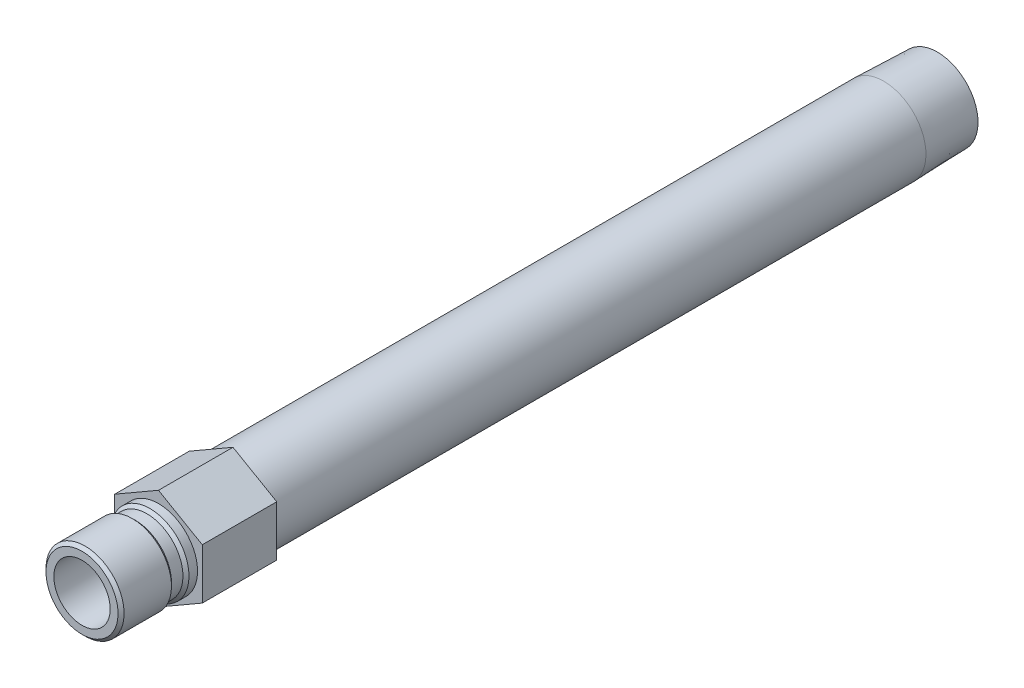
ISO-10303-21;
HEADER;
FILE_DESCRIPTION(('STEP AP214'),'2;1');
FILE_NAME('part.step','',(''),(''),'','','');
FILE_SCHEMA(('AUTOMOTIVE_DESIGN { 1 0 10303 214 1 1 1 1 }'));
ENDSEC;
DATA;
#1=APPLICATION_CONTEXT('core data for automotive mechanical design processes');
#2=APPLICATION_PROTOCOL_DEFINITION('international standard','automotive_design',2000,#1);
#3=PRODUCT_CONTEXT('',#1,'mechanical');
#4=PRODUCT('Part','Part','',(#3));
#5=PRODUCT_RELATED_PRODUCT_CATEGORY('part','',(#4));
#6=PRODUCT_DEFINITION_FORMATION('','',#4);
#7=PRODUCT_DEFINITION_CONTEXT('part definition',#1,'design');
#8=PRODUCT_DEFINITION('design','',#6,#7);
#9=PRODUCT_DEFINITION_SHAPE('','',#8);
#10=(LENGTH_UNIT() NAMED_UNIT(*) SI_UNIT(.MILLI.,.METRE.));
#11=(NAMED_UNIT(*) PLANE_ANGLE_UNIT() SI_UNIT($,.RADIAN.));
#12=(NAMED_UNIT(*) SI_UNIT($,.STERADIAN.) SOLID_ANGLE_UNIT());
#13=UNCERTAINTY_MEASURE_WITH_UNIT(LENGTH_MEASURE(1.E-05),#10,'distance_accuracy_value','');
#14=(GEOMETRIC_REPRESENTATION_CONTEXT(3) GLOBAL_UNCERTAINTY_ASSIGNED_CONTEXT((#13)) GLOBAL_UNIT_ASSIGNED_CONTEXT((#10,
#11,#12)) REPRESENTATION_CONTEXT('',''));
#15=CARTESIAN_POINT('',(0.,0.,0.));
#16=DIRECTION('',(0.,0.,1.));
#17=DIRECTION('',(1.,0.,0.));
#18=AXIS2_PLACEMENT_3D('',#15,#16,#17);
#19=CARTESIAN_POINT('',(0.,0.,0.));
#20=DIRECTION('',(0.,0.,-1.));
#21=DIRECTION('',(0.,1.,0.));
#22=AXIS2_PLACEMENT_3D('',#19,#20,#21);
#23=CYLINDRICAL_SURFACE('',#22,7.112);
#24=CARTESIAN_POINT('',(0.,0.,1.524));
#25=DIRECTION('',(0.,0.,-1.));
#26=DIRECTION('',(0.,1.,0.));
#27=AXIS2_PLACEMENT_3D('',#24,#25,#26);
#28=CIRCLE('',#27,7.112);
#29=CARTESIAN_POINT('',(0.,7.112,1.524));
#30=VERTEX_POINT('',#29);
#31=EDGE_CURVE('E147',#30,#30,#28,.T.);
#32=ORIENTED_EDGE('',*,*,#31,.T.);
#33=EDGE_LOOP('',(#32));
#34=FACE_BOUND('',#33,.T.);
#35=CARTESIAN_POINT('',(0.,0.,19.304));
#36=DIRECTION('',(0.,0.,-1.));
#37=DIRECTION('',(0.,1.,0.));
#38=AXIS2_PLACEMENT_3D('',#35,#36,#37);
#39=CIRCLE('',#38,7.112);
#40=CARTESIAN_POINT('',(0.,7.112,19.304));
#41=VERTEX_POINT('',#40);
#42=EDGE_CURVE('E42',#41,#41,#39,.T.);
#43=ORIENTED_EDGE('',*,*,#42,.F.);
#44=EDGE_LOOP('',(#43));
#45=FACE_BOUND('',#44,.T.);
#46=ADVANCED_FACE('F33',(#34,#45),#23,.F.);
#47=CARTESIAN_POINT('',(0.,7.112,19.304));
#48=DIRECTION('',(0.,0.,1.));
#49=DIRECTION('',(0.,-1.,0.));
#50=AXIS2_PLACEMENT_3D('',#47,#48,#49);
#51=PLANE('',#50);
#52=ORIENTED_EDGE('',*,*,#42,.T.);
#53=EDGE_LOOP('',(#52));
#54=FACE_BOUND('',#53,.T.);
#55=CARTESIAN_POINT('',(0.,0.,19.304));
#56=DIRECTION('',(0.,0.,-1.));
#57=DIRECTION('',(0.,1.,0.));
#58=AXIS2_PLACEMENT_3D('',#55,#56,#57);
#59=CIRCLE('',#58,9.0932);
#60=CARTESIAN_POINT('',(0.,9.0932,19.304));
#61=VERTEX_POINT('',#60);
#62=EDGE_CURVE('E180',#61,#61,#59,.T.);
#63=ORIENTED_EDGE('',*,*,#62,.F.);
#64=EDGE_LOOP('',(#63));
#65=FACE_BOUND('',#64,.T.);
#66=ADVANCED_FACE('F186',(#54,#65),#51,.T.);
#67=CARTESIAN_POINT('',(0.,0.,18.542));
#68=DIRECTION('',(0.,0.,-1.));
#69=DIRECTION('',(0.,1.,0.));
#70=AXIS2_PLACEMENT_3D('',#67,#68,#69);
#71=CONICAL_SURFACE('',#70,9.8552,0.785398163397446);
#72=ORIENTED_EDGE('',*,*,#62,.T.);
#73=EDGE_LOOP('',(#72));
#74=FACE_BOUND('',#73,.T.);
#75=CARTESIAN_POINT('',(0.,0.,18.542));
#76=DIRECTION('',(0.,0.,-1.));
#77=DIRECTION('',(0.,1.,0.));
#78=AXIS2_PLACEMENT_3D('',#75,#76,#77);
#79=CIRCLE('',#78,9.8552);
#80=CARTESIAN_POINT('',(0.,9.8552,18.542));
#81=VERTEX_POINT('',#80);
#82=EDGE_CURVE('E177',#81,#81,#79,.T.);
#83=ORIENTED_EDGE('',*,*,#82,.F.);
#84=EDGE_LOOP('',(#83));
#85=FACE_BOUND('',#84,.T.);
#86=ADVANCED_FACE('F194',(#74,#85),#71,.T.);
#87=CARTESIAN_POINT('',(0.,0.,0.));
#88=DIRECTION('',(0.,0.,-1.));
#89=DIRECTION('',(0.,1.,0.));
#90=AXIS2_PLACEMENT_3D('',#87,#88,#89);
#91=CYLINDRICAL_SURFACE('',#90,9.8552);
#92=ORIENTED_EDGE('',*,*,#82,.T.);
#93=EDGE_LOOP('',(#92));
#94=FACE_BOUND('',#93,.T.);
#95=CARTESIAN_POINT('',(0.,0.,6.5786));
#96=DIRECTION('',(0.,0.,-1.));
#97=DIRECTION('',(0.,1.,0.));
#98=AXIS2_PLACEMENT_3D('',#95,#96,#97);
#99=CIRCLE('',#98,9.8552);
#100=CARTESIAN_POINT('',(0.,9.8552,6.5786));
#101=VERTEX_POINT('',#100);
#102=EDGE_CURVE('E174',#101,#101,#99,.T.);
#103=ORIENTED_EDGE('',*,*,#102,.F.);
#104=EDGE_LOOP('',(#103));
#105=FACE_BOUND('',#104,.T.);
#106=ADVANCED_FACE('F249',(#94,#105),#91,.T.);
#107=CARTESIAN_POINT('',(0.,0.,5.8166));
#108=DIRECTION('',(0.,0.,1.));
#109=DIRECTION('',(0.,-1.,0.));
#110=AXIS2_PLACEMENT_3D('',#107,#108,#109);
#111=CONICAL_SURFACE('',#110,9.0932,0.785398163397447);
#112=ORIENTED_EDGE('',*,*,#102,.T.);
#113=EDGE_LOOP('',(#112));
#114=FACE_BOUND('',#113,.T.);
#115=CARTESIAN_POINT('',(0.,0.,5.8166));
#116=DIRECTION('',(0.,0.,-1.));
#117=DIRECTION('',(0.,1.,0.));
#118=AXIS2_PLACEMENT_3D('',#115,#116,#117);
#119=CIRCLE('',#118,9.0932);
#120=CARTESIAN_POINT('',(0.,9.0932,5.8166));
#121=VERTEX_POINT('',#120);
#122=EDGE_CURVE('E171',#121,#121,#119,.T.);
#123=ORIENTED_EDGE('',*,*,#122,.F.);
#124=EDGE_LOOP('',(#123));
#125=FACE_BOUND('',#124,.T.);
#126=ADVANCED_FACE('F245',(#114,#125),#111,.T.);
#127=CARTESIAN_POINT('',(0.,0.,0.));
#128=DIRECTION('',(0.,0.,-1.));
#129=DIRECTION('',(0.,1.,0.));
#130=AXIS2_PLACEMENT_3D('',#127,#128,#129);
#131=CYLINDRICAL_SURFACE('',#130,9.0932);
#132=ORIENTED_EDGE('',*,*,#122,.T.);
#133=EDGE_LOOP('',(#132));
#134=FACE_BOUND('',#133,.T.);
#135=CARTESIAN_POINT('',(0.,0.,2.921));
#136=DIRECTION('',(0.,0.,-1.));
#137=DIRECTION('',(0.,1.,0.));
#138=AXIS2_PLACEMENT_3D('',#135,#136,#137);
#139=CIRCLE('',#138,9.0932);
#140=CARTESIAN_POINT('',(0.,9.0932,2.921));
#141=VERTEX_POINT('',#140);
#142=EDGE_CURVE('E168',#141,#141,#139,.T.);
#143=ORIENTED_EDGE('',*,*,#142,.F.);
#144=EDGE_LOOP('',(#143));
#145=FACE_BOUND('',#144,.T.);
#146=ADVANCED_FACE('F241',(#134,#145),#131,.T.);
#147=CARTESIAN_POINT('',(0.,0.,2.159));
#148=DIRECTION('',(0.,0.,-1.));
#149=DIRECTION('',(0.,1.,0.));
#150=AXIS2_PLACEMENT_3D('',#147,#148,#149);
#151=CONICAL_SURFACE('',#150,9.8552,0.785398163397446);
#152=ORIENTED_EDGE('',*,*,#142,.T.);
#153=EDGE_LOOP('',(#152));
#154=FACE_BOUND('',#153,.T.);
#155=CARTESIAN_POINT('',(0.,0.,2.159));
#156=DIRECTION('',(0.,0.,-1.));
#157=DIRECTION('',(0.,1.,0.));
#158=AXIS2_PLACEMENT_3D('',#155,#156,#157);
#159=CIRCLE('',#158,9.8552);
#160=CARTESIAN_POINT('',(0.,9.8552,2.159));
#161=VERTEX_POINT('',#160);
#162=EDGE_CURVE('E165',#161,#161,#159,.T.);
#163=ORIENTED_EDGE('',*,*,#162,.F.);
#164=EDGE_LOOP('',(#163));
#165=FACE_BOUND('',#164,.T.);
#166=ADVANCED_FACE('F237',(#154,#165),#151,.T.);
#167=CARTESIAN_POINT('',(0.,0.,0.));
#168=DIRECTION('',(0.,0.,-1.));
#169=DIRECTION('',(0.,1.,0.));
#170=AXIS2_PLACEMENT_3D('',#167,#168,#169);
#171=CYLINDRICAL_SURFACE('',#170,9.8552);
#172=ORIENTED_EDGE('',*,*,#162,.T.);
#173=EDGE_LOOP('',(#172));
#174=FACE_BOUND('',#173,.T.);
#175=CARTESIAN_POINT('',(0.,0.,0.));
#176=DIRECTION('',(0.,0.,-1.));
#177=DIRECTION('',(0.,1.,0.));
#178=AXIS2_PLACEMENT_3D('',#175,#176,#177);
#179=CIRCLE('',#178,9.8552);
#180=CARTESIAN_POINT('',(0.,9.8552,0.));
#181=VERTEX_POINT('',#180);
#182=EDGE_CURVE('E162',#181,#181,#179,.T.);
#183=ORIENTED_EDGE('',*,*,#182,.F.);
#184=EDGE_LOOP('',(#183));
#185=FACE_BOUND('',#184,.T.);
#186=ADVANCED_FACE('F233',(#174,#185),#171,.T.);
#187=CARTESIAN_POINT('',(0.,9.8552,0.));
#188=DIRECTION('',(0.,0.,1.));
#189=DIRECTION('',(0.,-1.,0.));
#190=AXIS2_PLACEMENT_3D('',#187,#188,#189);
#191=PLANE('',#190);
#192=ORIENTED_EDGE('',*,*,#182,.T.);
#193=EDGE_LOOP('',(#192));
#194=FACE_BOUND('',#193,.T.);
#195=DIRECTION('',(-0.866025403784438,-0.5,0.));
#196=VECTOR('',#195,1.);
#197=CARTESIAN_POINT('',(0.,12.7582862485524,0.));
#198=LINE('',#197,#196);
#199=CARTESIAN_POINT('',(0.,12.7582862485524,0.));
#200=VERTEX_POINT('',#199);
#201=CARTESIAN_POINT('',(-11.049,6.37914312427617,0.));
#202=VERTEX_POINT('',#201);
#203=EDGE_CURVE('E121',#200,#202,#198,.T.);
#204=ORIENTED_EDGE('',*,*,#203,.T.);
#205=DIRECTION('',(0.,-1.,0.));
#206=VECTOR('',#205,1.);
#207=CARTESIAN_POINT('',(-11.049,6.37914312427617,0.));
#208=LINE('',#207,#206);
#209=CARTESIAN_POINT('',(-11.049,-6.37914312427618,0.));
#210=VERTEX_POINT('',#209);
#211=EDGE_CURVE('E124',#202,#210,#208,.T.);
#212=ORIENTED_EDGE('',*,*,#211,.T.);
#213=DIRECTION('',(0.866025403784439,-0.5,0.));
#214=VECTOR('',#213,1.);
#215=CARTESIAN_POINT('',(-11.049,-6.37914312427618,0.));
#216=LINE('',#215,#214);
#217=CARTESIAN_POINT('',(0.,-12.7582862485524,0.));
#218=VERTEX_POINT('',#217);
#219=EDGE_CURVE('E128',#210,#218,#216,.T.);
#220=ORIENTED_EDGE('',*,*,#219,.T.);
#221=DIRECTION('',(0.866025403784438,0.5,0.));
#222=VECTOR('',#221,1.);
#223=CARTESIAN_POINT('',(0.,-12.7582862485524,0.));
#224=LINE('',#223,#222);
#225=CARTESIAN_POINT('',(11.049,-6.37914312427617,0.));
#226=VERTEX_POINT('',#225);
#227=EDGE_CURVE('E131',#218,#226,#224,.T.);
#228=ORIENTED_EDGE('',*,*,#227,.T.);
#229=DIRECTION('',(0.,1.,0.));
#230=VECTOR('',#229,1.);
#231=CARTESIAN_POINT('',(11.049,-6.37914312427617,0.));
#232=LINE('',#231,#230);
#233=CARTESIAN_POINT('',(11.049,6.37914312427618,0.));
#234=VERTEX_POINT('',#233);
#235=EDGE_CURVE('E98',#226,#234,#232,.T.);
#236=ORIENTED_EDGE('',*,*,#235,.T.);
#237=DIRECTION('',(-0.866025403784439,0.5,0.));
#238=VECTOR('',#237,1.);
#239=CARTESIAN_POINT('',(11.049,6.37914312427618,0.));
#240=LINE('',#239,#238);
#241=EDGE_CURVE('E134',#234,#200,#240,.T.);
#242=ORIENTED_EDGE('',*,*,#241,.T.);
#243=EDGE_LOOP('',(#204,#212,#220,#228,#236,#242));
#244=FACE_BOUND('',#243,.T.);
#245=ADVANCED_FACE('F210',(#194,#244),#191,.T.);
#246=CARTESIAN_POINT('',(0.,0.,0.));
#247=DIRECTION('',(0.,0.,-1.));
#248=DIRECTION('',(0.,1.,0.));
#249=AXIS2_PLACEMENT_3D('',#246,#247,#248);
#250=CYLINDRICAL_SURFACE('',#249,7.89939999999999);
#251=CARTESIAN_POINT('',(0.,0.,0.));
#252=DIRECTION('',(0.,0.,1.));
#253=DIRECTION('',(1.,0.,0.));
#254=AXIS2_PLACEMENT_3D('',#251,#252,#253);
#255=CIRCLE('',#254,7.89939999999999);
#256=CARTESIAN_POINT('',(7.89939999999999,0.,0.));
#257=VERTEX_POINT('',#256);
#258=EDGE_CURVE('E11',#257,#257,#255,.T.);
#259=ORIENTED_EDGE('',*,*,#258,.F.);
#260=EDGE_LOOP('',(#259));
#261=FACE_BOUND('',#260,.T.);
#262=CARTESIAN_POINT('',(0.,0.,1.10533199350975));
#263=DIRECTION('',(0.,0.,-1.));
#264=DIRECTION('',(0.,1.,0.));
#265=AXIS2_PLACEMENT_3D('',#262,#263,#264);
#266=CIRCLE('',#265,7.8994);
#267=CARTESIAN_POINT('',(0.,7.8994,1.10533199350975));
#268=VERTEX_POINT('',#267);
#269=EDGE_CURVE('E150',#268,#268,#266,.T.);
#270=ORIENTED_EDGE('',*,*,#269,.F.);
#271=EDGE_LOOP('',(#270));
#272=FACE_BOUND('',#271,.T.);
#273=ADVANCED_FACE('F200',(#261,#272),#250,.F.);
#274=CARTESIAN_POINT('',(0.,0.,1.524));
#275=DIRECTION('',(0.,0.,-1.));
#276=DIRECTION('',(0.,1.,0.));
#277=AXIS2_PLACEMENT_3D('',#274,#275,#276);
#278=CONICAL_SURFACE('',#277,7.112,1.08210413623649);
#279=ORIENTED_EDGE('',*,*,#269,.T.);
#280=EDGE_LOOP('',(#279));
#281=FACE_BOUND('',#280,.T.);
#282=ORIENTED_EDGE('',*,*,#31,.F.);
#283=EDGE_LOOP('',(#282));
#284=FACE_BOUND('',#283,.T.);
#285=ADVANCED_FACE('F197',(#281,#284),#278,.F.);
#286=CARTESIAN_POINT('',(-11.049,6.37914312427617,-18.796));
#287=DIRECTION('',(0.,0.,1.));
#288=DIRECTION('',(1.,0.,0.));
#289=AXIS2_PLACEMENT_3D('',#286,#287,#288);
#290=PLANE('',#289);
#291=CARTESIAN_POINT('',(0.,0.,-18.796));
#292=DIRECTION('',(0.,0.,1.));
#293=DIRECTION('',(1.,0.,0.));
#294=AXIS2_PLACEMENT_3D('',#291,#292,#293);
#295=CIRCLE('',#294,7.89939999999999);
#296=CARTESIAN_POINT('',(7.89939999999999,0.,-18.796));
#297=VERTEX_POINT('',#296);
#298=EDGE_CURVE('E36',#297,#297,#295,.T.);
#299=ORIENTED_EDGE('',*,*,#298,.F.);
#300=EDGE_LOOP('',(#299));
#301=FACE_BOUND('',#300,.T.);
#302=CARTESIAN_POINT('',(0.,0.,-18.796));
#303=DIRECTION('',(0.,0.,1.));
#304=DIRECTION('',(1.,0.,0.));
#305=AXIS2_PLACEMENT_3D('',#302,#303,#304);
#306=CIRCLE('',#305,7.112);
#307=CARTESIAN_POINT('',(7.112,0.,-18.796));
#308=VERTEX_POINT('',#307);
#309=EDGE_CURVE('E125',#308,#308,#306,.T.);
#310=ORIENTED_EDGE('',*,*,#309,.T.);
#311=EDGE_LOOP('',(#310));
#312=FACE_BOUND('',#311,.T.);
#313=ADVANCED_FACE('F199',(#301,#312),#290,.F.);
#314=CARTESIAN_POINT('',(0.,0.,-18.796));
#315=DIRECTION('',(0.,0.,1.));
#316=DIRECTION('',(1.,0.,0.));
#317=AXIS2_PLACEMENT_3D('',#314,#315,#316);
#318=CYLINDRICAL_SURFACE('',#317,7.112);
#319=ORIENTED_EDGE('',*,*,#309,.F.);
#320=EDGE_LOOP('',(#319));
#321=FACE_BOUND('',#320,.T.);
#322=CARTESIAN_POINT('',(0.,0.,0.));
#323=DIRECTION('',(0.,0.,1.));
#324=DIRECTION('',(1.,0.,0.));
#325=AXIS2_PLACEMENT_3D('',#322,#323,#324);
#326=CIRCLE('',#325,7.112);
#327=CARTESIAN_POINT('',(7.112,0.,0.));
#328=VERTEX_POINT('',#327);
#329=EDGE_CURVE('E443',#328,#328,#326,.T.);
#330=ORIENTED_EDGE('',*,*,#329,.T.);
#331=EDGE_LOOP('',(#330));
#332=FACE_BOUND('',#331,.T.);
#333=ADVANCED_FACE('F207',(#321,#332),#318,.F.);
#334=CARTESIAN_POINT('',(-11.049,6.37914312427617,0.));
#335=DIRECTION('',(0.,0.,1.));
#336=DIRECTION('',(1.,0.,0.));
#337=AXIS2_PLACEMENT_3D('',#334,#335,#336);
#338=PLANE('',#337);
#339=ORIENTED_EDGE('',*,*,#258,.T.);
#340=EDGE_LOOP('',(#339));
#341=FACE_BOUND('',#340,.T.);
#342=ORIENTED_EDGE('',*,*,#329,.F.);
#343=EDGE_LOOP('',(#342));
#344=FACE_BOUND('',#343,.T.);
#345=ADVANCED_FACE('F221',(#341,#344),#338,.T.);
#346=CARTESIAN_POINT('',(0.,10.244140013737,-196.596));
#347=DIRECTION('',(0.,0.,-1.));
#348=DIRECTION('',(0.,1.,0.));
#349=AXIS2_PLACEMENT_3D('',#346,#347,#348);
#350=PLANE('',#349);
#351=CARTESIAN_POINT('',(0.,0.,-196.596));
#352=DIRECTION('',(0.,0.,-1.));
#353=DIRECTION('',(0.,1.,0.));
#354=AXIS2_PLACEMENT_3D('',#351,#352,#353);
#355=CIRCLE('',#354,10.2441400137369);
#356=CARTESIAN_POINT('',(0.,10.244140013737,-196.596));
#357=VERTEX_POINT('',#356);
#358=EDGE_CURVE('E156',#357,#357,#355,.T.);
#359=ORIENTED_EDGE('',*,*,#358,.T.);
#360=EDGE_LOOP('',(#359));
#361=FACE_BOUND('',#360,.T.);
#362=CARTESIAN_POINT('',(0.,0.,-196.596));
#363=DIRECTION('',(0.,0.,-1.));
#364=DIRECTION('',(0.,1.,0.));
#365=AXIS2_PLACEMENT_3D('',#362,#363,#364);
#366=CIRCLE('',#365,7.89939999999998);
#367=CARTESIAN_POINT('',(0.,7.8994,-196.596));
#368=VERTEX_POINT('',#367);
#369=EDGE_CURVE('E153',#368,#368,#366,.T.);
#370=ORIENTED_EDGE('',*,*,#369,.F.);
#371=EDGE_LOOP('',(#370));
#372=FACE_BOUND('',#371,.T.);
#373=ADVANCED_FACE('F218',(#361,#372),#350,.T.);
#374=ORIENTED_EDGE('',*,*,#369,.T.);
#375=EDGE_LOOP('',(#374));
#376=FACE_BOUND('',#375,.T.);
#377=ORIENTED_EDGE('',*,*,#298,.T.);
#378=EDGE_LOOP('',(#377));
#379=FACE_BOUND('',#378,.T.);
#380=ADVANCED_FACE('F213',(#376,#379),#250,.F.);
#381=CARTESIAN_POINT('',(0.,0.,-196.596));
#382=DIRECTION('',(0.,0.,1.));
#383=DIRECTION('',(0.,-1.,0.));
#384=AXIS2_PLACEMENT_3D('',#381,#382,#383);
#385=CONICAL_SURFACE('',#384,10.2441400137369,0.0312396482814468);
#386=CARTESIAN_POINT('',(0.,0.,-183.0324));
#387=DIRECTION('',(0.,0.,-1.));
#388=DIRECTION('',(0.,1.,0.));
#389=AXIS2_PLACEMENT_3D('',#386,#387,#388);
#390=CIRCLE('',#389,10.668);
#391=CARTESIAN_POINT('',(0.,10.668,-183.0324));
#392=VERTEX_POINT('',#391);
#393=EDGE_CURVE('E159',#392,#392,#390,.T.);
#394=ORIENTED_EDGE('',*,*,#393,.T.);
#395=EDGE_LOOP('',(#394));
#396=FACE_BOUND('',#395,.T.);
#397=ORIENTED_EDGE('',*,*,#358,.F.);
#398=EDGE_LOOP('',(#397));
#399=FACE_BOUND('',#398,.T.);
#400=ADVANCED_FACE('F223',(#396,#399),#385,.T.);
#401=CARTESIAN_POINT('',(0.,0.,0.));
#402=DIRECTION('',(0.,0.,-1.));
#403=DIRECTION('',(0.,1.,0.));
#404=AXIS2_PLACEMENT_3D('',#401,#402,#403);
#405=CYLINDRICAL_SURFACE('',#404,10.668);
#406=ORIENTED_EDGE('',*,*,#393,.F.);
#407=EDGE_LOOP('',(#406));
#408=FACE_BOUND('',#407,.T.);
#409=CARTESIAN_POINT('',(0.,0.,-18.796));
#410=DIRECTION('',(0.,0.,1.));
#411=DIRECTION('',(1.,0.,0.));
#412=AXIS2_PLACEMENT_3D('',#409,#410,#411);
#413=CIRCLE('',#412,10.668);
#414=CARTESIAN_POINT('',(10.668,0.,-18.796));
#415=VERTEX_POINT('',#414);
#416=EDGE_CURVE('E144',#415,#415,#413,.F.);
#417=ORIENTED_EDGE('',*,*,#416,.T.);
#418=EDGE_LOOP('',(#417));
#419=FACE_BOUND('',#418,.T.);
#420=ADVANCED_FACE('F226',(#408,#419),#405,.T.);
#421=ORIENTED_EDGE('',*,*,#416,.F.);
#422=EDGE_LOOP('',(#421));
#423=FACE_BOUND('',#422,.T.);
#424=DIRECTION('',(-0.866025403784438,-0.5,0.));
#425=VECTOR('',#424,1.);
#426=CARTESIAN_POINT('',(0.,12.7582862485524,-18.796));
#427=LINE('',#426,#425);
#428=CARTESIAN_POINT('',(0.,12.7582862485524,-18.796));
#429=VERTEX_POINT('',#428);
#430=CARTESIAN_POINT('',(-11.049,6.37914312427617,-18.796));
#431=VERTEX_POINT('',#430);
#432=EDGE_CURVE('E137',#429,#431,#427,.T.);
#433=ORIENTED_EDGE('',*,*,#432,.F.);
#434=DIRECTION('',(-0.866025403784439,0.5,0.));
#435=VECTOR('',#434,1.);
#436=CARTESIAN_POINT('',(11.049,6.37914312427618,-18.796));
#437=LINE('',#436,#435);
#438=CARTESIAN_POINT('',(11.049,6.37914312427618,-18.796));
#439=VERTEX_POINT('',#438);
#440=EDGE_CURVE('E111',#439,#429,#437,.T.);
#441=ORIENTED_EDGE('',*,*,#440,.F.);
#442=DIRECTION('',(0.,1.,0.));
#443=VECTOR('',#442,1.);
#444=CARTESIAN_POINT('',(11.049,-6.37914312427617,-18.796));
#445=LINE('',#444,#443);
#446=CARTESIAN_POINT('',(11.049,-6.37914312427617,-18.796));
#447=VERTEX_POINT('',#446);
#448=EDGE_CURVE('E96',#447,#439,#445,.T.);
#449=ORIENTED_EDGE('',*,*,#448,.F.);
#450=DIRECTION('',(0.866025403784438,0.5,0.));
#451=VECTOR('',#450,1.);
#452=CARTESIAN_POINT('',(0.,-12.7582862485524,-18.796));
#453=LINE('',#452,#451);
#454=CARTESIAN_POINT('',(0.,-12.7582862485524,-18.796));
#455=VERTEX_POINT('',#454);
#456=EDGE_CURVE('E109',#455,#447,#453,.T.);
#457=ORIENTED_EDGE('',*,*,#456,.F.);
#458=DIRECTION('',(0.866025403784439,-0.5,0.));
#459=VECTOR('',#458,1.);
#460=CARTESIAN_POINT('',(-11.049,-6.37914312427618,-18.796));
#461=LINE('',#460,#459);
#462=CARTESIAN_POINT('',(-11.049,-6.37914312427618,-18.796));
#463=VERTEX_POINT('',#462);
#464=EDGE_CURVE('E114',#463,#455,#461,.T.);
#465=ORIENTED_EDGE('',*,*,#464,.F.);
#466=DIRECTION('',(0.,-1.,0.));
#467=VECTOR('',#466,1.);
#468=CARTESIAN_POINT('',(-11.049,6.37914312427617,-18.796));
#469=LINE('',#468,#467);
#470=EDGE_CURVE('E116',#431,#463,#469,.T.);
#471=ORIENTED_EDGE('',*,*,#470,.F.);
#472=EDGE_LOOP('',(#433,#441,#449,#457,#465,#471));
#473=FACE_BOUND('',#472,.T.);
#474=ADVANCED_FACE('F107',(#423,#473),#290,.F.);
#475=CARTESIAN_POINT('',(0.,12.7582862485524,-18.796));
#476=DIRECTION('',(-0.5,0.866025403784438,0.));
#477=DIRECTION('',(-0.866025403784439,-0.5,0.));
#478=AXIS2_PLACEMENT_3D('',#475,#476,#477);
#479=PLANE('',#478);
#480=ORIENTED_EDGE('',*,*,#203,.F.);
#481=DIRECTION('',(0.,0.,1.));
#482=VECTOR('',#481,1.);
#483=CARTESIAN_POINT('',(0.,12.7582862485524,-18.796));
#484=LINE('',#483,#482);
#485=EDGE_CURVE('E50',#429,#200,#484,.T.);
#486=ORIENTED_EDGE('',*,*,#485,.F.);
#487=ORIENTED_EDGE('',*,*,#432,.T.);
#488=DIRECTION('',(0.,0.,1.));
#489=VECTOR('',#488,1.);
#490=CARTESIAN_POINT('',(-11.049,6.37914312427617,-18.796));
#491=LINE('',#490,#489);
#492=EDGE_CURVE('E85',#431,#202,#491,.T.);
#493=ORIENTED_EDGE('',*,*,#492,.T.);
#494=EDGE_LOOP('',(#480,#486,#487,#493));
#495=FACE_BOUND('',#494,.T.);
#496=ADVANCED_FACE('F215',(#495),#479,.T.);
#497=CARTESIAN_POINT('',(11.049,6.37914312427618,-18.796));
#498=DIRECTION('',(0.5,0.866025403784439,0.));
#499=DIRECTION('',(-0.866025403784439,0.5,0.));
#500=AXIS2_PLACEMENT_3D('',#497,#498,#499);
#501=PLANE('',#500);
#502=ORIENTED_EDGE('',*,*,#241,.F.);
#503=DIRECTION('',(0.,0.,1.));
#504=VECTOR('',#503,1.);
#505=CARTESIAN_POINT('',(11.049,6.37914312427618,-18.796));
#506=LINE('',#505,#504);
#507=EDGE_CURVE('E73',#439,#234,#506,.T.);
#508=ORIENTED_EDGE('',*,*,#507,.F.);
#509=ORIENTED_EDGE('',*,*,#440,.T.);
#510=ORIENTED_EDGE('',*,*,#485,.T.);
#511=EDGE_LOOP('',(#502,#508,#509,#510));
#512=FACE_BOUND('',#511,.T.);
#513=ADVANCED_FACE('F276',(#512),#501,.T.);
#514=CARTESIAN_POINT('',(11.049,-6.37914312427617,-18.796));
#515=DIRECTION('',(1.,0.,0.));
#516=DIRECTION('',(0.,1.,0.));
#517=AXIS2_PLACEMENT_3D('',#514,#515,#516);
#518=PLANE('',#517);
#519=ORIENTED_EDGE('',*,*,#235,.F.);
#520=DIRECTION('',(0.,0.,1.));
#521=VECTOR('',#520,1.);
#522=CARTESIAN_POINT('',(11.049,-6.37914312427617,-18.796));
#523=LINE('',#522,#521);
#524=EDGE_CURVE('E93',#447,#226,#523,.T.);
#525=ORIENTED_EDGE('',*,*,#524,.F.);
#526=ORIENTED_EDGE('',*,*,#448,.T.);
#527=ORIENTED_EDGE('',*,*,#507,.T.);
#528=EDGE_LOOP('',(#519,#525,#526,#527));
#529=FACE_BOUND('',#528,.T.);
#530=ADVANCED_FACE('F95',(#529),#518,.T.);
#531=CARTESIAN_POINT('',(0.,-12.7582862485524,-18.796));
#532=DIRECTION('',(0.5,-0.866025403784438,0.));
#533=DIRECTION('',(0.866025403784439,0.5,0.));
#534=AXIS2_PLACEMENT_3D('',#531,#532,#533);
#535=PLANE('',#534);
#536=ORIENTED_EDGE('',*,*,#227,.F.);
#537=DIRECTION('',(0.,0.,1.));
#538=VECTOR('',#537,1.);
#539=CARTESIAN_POINT('',(0.,-12.7582862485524,-18.796));
#540=LINE('',#539,#538);
#541=EDGE_CURVE('E103',#455,#218,#540,.T.);
#542=ORIENTED_EDGE('',*,*,#541,.F.);
#543=ORIENTED_EDGE('',*,*,#456,.T.);
#544=ORIENTED_EDGE('',*,*,#524,.T.);
#545=EDGE_LOOP('',(#536,#542,#543,#544));
#546=FACE_BOUND('',#545,.T.);
#547=ADVANCED_FACE('F113',(#546),#535,.T.);
#548=CARTESIAN_POINT('',(-11.049,-6.37914312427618,-18.796));
#549=DIRECTION('',(-0.5,-0.866025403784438,0.));
#550=DIRECTION('',(0.866025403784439,-0.5,0.));
#551=AXIS2_PLACEMENT_3D('',#548,#549,#550);
#552=PLANE('',#551);
#553=ORIENTED_EDGE('',*,*,#219,.F.);
#554=DIRECTION('',(0.,0.,1.));
#555=VECTOR('',#554,1.);
#556=CARTESIAN_POINT('',(-11.049,-6.37914312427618,-18.796));
#557=LINE('',#556,#555);
#558=EDGE_CURVE('E141',#463,#210,#557,.T.);
#559=ORIENTED_EDGE('',*,*,#558,.F.);
#560=ORIENTED_EDGE('',*,*,#464,.T.);
#561=ORIENTED_EDGE('',*,*,#541,.T.);
#562=EDGE_LOOP('',(#553,#559,#560,#561));
#563=FACE_BOUND('',#562,.T.);
#564=ADVANCED_FACE('F275',(#563),#552,.T.);
#565=CARTESIAN_POINT('',(-11.049,6.37914312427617,-18.796));
#566=DIRECTION('',(-1.,0.,0.));
#567=DIRECTION('',(0.,0.,1.));
#568=AXIS2_PLACEMENT_3D('',#565,#566,#567);
#569=PLANE('',#568);
#570=ORIENTED_EDGE('',*,*,#211,.F.);
#571=ORIENTED_EDGE('',*,*,#492,.F.);
#572=ORIENTED_EDGE('',*,*,#470,.T.);
#573=ORIENTED_EDGE('',*,*,#558,.T.);
#574=EDGE_LOOP('',(#570,#571,#572,#573));
#575=FACE_BOUND('',#574,.T.);
#576=ADVANCED_FACE('F272',(#575),#569,.T.);
#577=CLOSED_SHELL('',(#46,#66,#86,#106,#126,#146,#166,#186,#245,#273,#285,#313,#333,#345,#373,
#380,#400,#420,#474,#496,#513,#530,#547,#564,#576));
#578=MANIFOLD_SOLID_BREP('B2',#577);
#579=ADVANCED_BREP_SHAPE_REPRESENTATION('',(#18,#578),#14);
#580=SHAPE_DEFINITION_REPRESENTATION(#9,#579);
ENDSEC;
END-ISO-10303-21;
